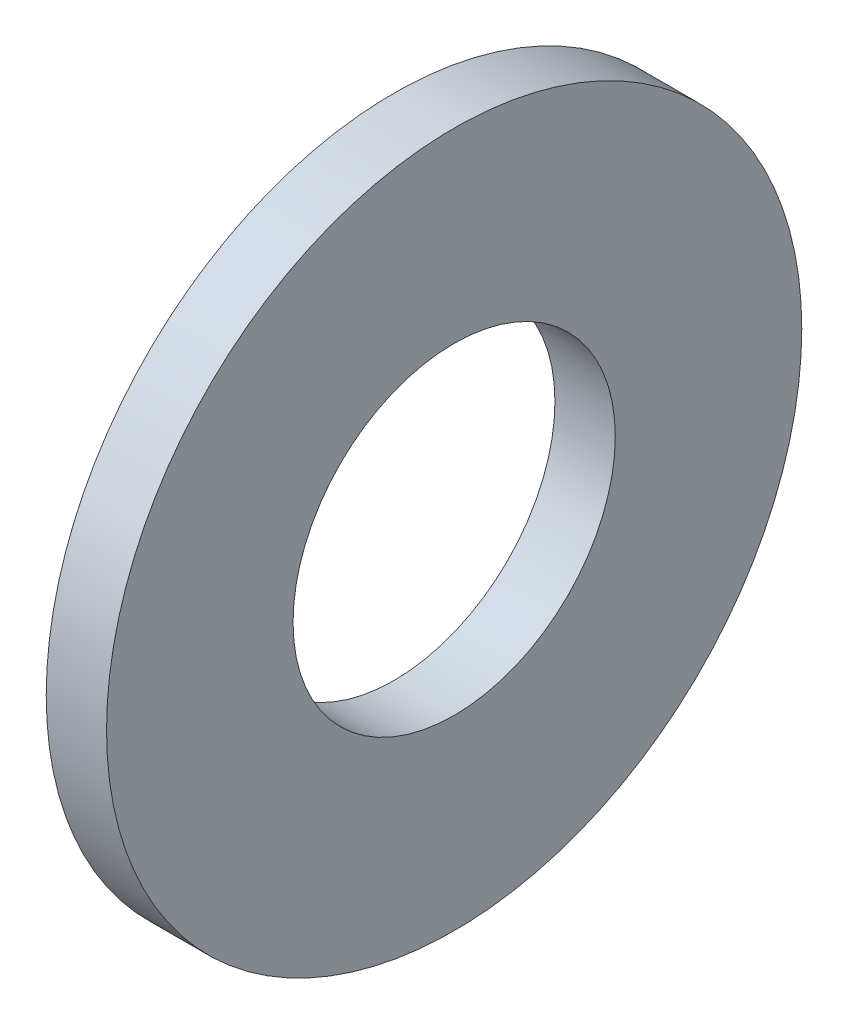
ISO-10303-21;
HEADER;
FILE_DESCRIPTION(('STEP AP214'),'2;1');
FILE_NAME('part.step','',(''),(''),'','','');
FILE_SCHEMA(('AUTOMOTIVE_DESIGN { 1 0 10303 214 1 1 1 1 }'));
ENDSEC;
DATA;
#1=APPLICATION_CONTEXT('core data for automotive mechanical design processes');
#2=APPLICATION_PROTOCOL_DEFINITION('international standard','automotive_design',2000,#1);
#3=PRODUCT_CONTEXT('',#1,'mechanical');
#4=PRODUCT('Part','Part','',(#3));
#5=PRODUCT_RELATED_PRODUCT_CATEGORY('part','',(#4));
#6=PRODUCT_DEFINITION_FORMATION('','',#4);
#7=PRODUCT_DEFINITION_CONTEXT('part definition',#1,'design');
#8=PRODUCT_DEFINITION('design','',#6,#7);
#9=PRODUCT_DEFINITION_SHAPE('','',#8);
#10=(LENGTH_UNIT() NAMED_UNIT(*) SI_UNIT(.MILLI.,.METRE.));
#11=(NAMED_UNIT(*) PLANE_ANGLE_UNIT() SI_UNIT($,.RADIAN.));
#12=(NAMED_UNIT(*) SI_UNIT($,.STERADIAN.) SOLID_ANGLE_UNIT());
#13=UNCERTAINTY_MEASURE_WITH_UNIT(LENGTH_MEASURE(1.E-05),#10,'distance_accuracy_value','');
#14=(GEOMETRIC_REPRESENTATION_CONTEXT(3) GLOBAL_UNCERTAINTY_ASSIGNED_CONTEXT((#13)) GLOBAL_UNIT_ASSIGNED_CONTEXT((#10,
#11,#12)) REPRESENTATION_CONTEXT('',''));
#15=CARTESIAN_POINT('',(0.,0.,0.));
#16=DIRECTION('',(0.,0.,1.));
#17=DIRECTION('',(1.,0.,0.));
#18=AXIS2_PLACEMENT_3D('',#15,#16,#17);
#19=CARTESIAN_POINT('',(0.9652,0.,0.));
#20=DIRECTION('',(1.,0.,0.));
#21=DIRECTION('',(0.,0.,-1.));
#22=AXIS2_PLACEMENT_3D('',#19,#20,#21);
#23=PLANE('',#22);
#24=CARTESIAN_POINT('',(0.9652,0.,0.));
#25=DIRECTION('',(1.,0.,0.));
#26=DIRECTION('',(0.,0.,-1.));
#27=AXIS2_PLACEMENT_3D('',#24,#25,#26);
#28=CIRCLE('',#27,5.5626);
#29=CARTESIAN_POINT('',(0.9652,0.,5.5626));
#30=VERTEX_POINT('',#29);
#31=EDGE_CURVE('E10',#30,#30,#28,.T.);
#32=ORIENTED_EDGE('',*,*,#31,.T.);
#33=EDGE_LOOP('',(#32));
#34=FACE_BOUND('',#33,.T.);
#35=CARTESIAN_POINT('',(0.9652,0.,0.));
#36=DIRECTION('',(1.,0.,0.));
#37=DIRECTION('',(0.,0.,-1.));
#38=AXIS2_PLACEMENT_3D('',#35,#36,#37);
#39=CIRCLE('',#38,2.5781);
#40=CARTESIAN_POINT('',(0.9652,0.,2.5781));
#41=VERTEX_POINT('',#40);
#42=EDGE_CURVE('E41',#41,#41,#39,.T.);
#43=ORIENTED_EDGE('',*,*,#42,.F.);
#44=EDGE_LOOP('',(#43));
#45=FACE_BOUND('',#44,.T.);
#46=ADVANCED_FACE('F30',(#34,#45),#23,.T.);
#47=CARTESIAN_POINT('',(0.,0.,0.));
#48=DIRECTION('',(1.,0.,0.));
#49=DIRECTION('',(0.,0.,-1.));
#50=AXIS2_PLACEMENT_3D('',#47,#48,#49);
#51=PLANE('',#50);
#52=CARTESIAN_POINT('',(0.,0.,0.));
#53=DIRECTION('',(1.,0.,0.));
#54=DIRECTION('',(0.,0.,-1.));
#55=AXIS2_PLACEMENT_3D('',#52,#53,#54);
#56=CIRCLE('',#55,5.5626);
#57=CARTESIAN_POINT('',(0.,0.,5.5626));
#58=VERTEX_POINT('',#57);
#59=EDGE_CURVE('E34',#58,#58,#56,.T.);
#60=ORIENTED_EDGE('',*,*,#59,.F.);
#61=EDGE_LOOP('',(#60));
#62=FACE_BOUND('',#61,.T.);
#63=CARTESIAN_POINT('',(0.,0.,0.));
#64=DIRECTION('',(1.,0.,0.));
#65=DIRECTION('',(0.,0.,-1.));
#66=AXIS2_PLACEMENT_3D('',#63,#64,#65);
#67=CIRCLE('',#66,2.5781);
#68=CARTESIAN_POINT('',(0.,0.,2.5781));
#69=VERTEX_POINT('',#68);
#70=EDGE_CURVE('E43',#69,#69,#67,.T.);
#71=ORIENTED_EDGE('',*,*,#70,.T.);
#72=EDGE_LOOP('',(#71));
#73=FACE_BOUND('',#72,.T.);
#74=ADVANCED_FACE('F53',(#62,#73),#51,.F.);
#75=CARTESIAN_POINT('',(0.9652,0.,0.));
#76=DIRECTION('',(-1.,0.,0.));
#77=DIRECTION('',(0.,0.,1.));
#78=AXIS2_PLACEMENT_3D('',#75,#76,#77);
#79=CYLINDRICAL_SURFACE('',#78,5.5626);
#80=CARTESIAN_POINT('',(0.9652,0.,5.5626));
#81=CARTESIAN_POINT('',(0.955145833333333,0.,5.5626));
#82=CARTESIAN_POINT('',(0.945091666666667,0.,5.5626));
#83=CARTESIAN_POINT('',(0.924983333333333,0.,5.5626));
#84=CARTESIAN_POINT('',(0.914929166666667,0.,5.5626));
#85=CARTESIAN_POINT('',(0.894820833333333,0.,5.5626));
#86=CARTESIAN_POINT('',(0.884766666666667,0.,5.5626));
#87=CARTESIAN_POINT('',(0.864658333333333,0.,5.5626));
#88=CARTESIAN_POINT('',(0.854604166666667,0.,5.5626));
#89=CARTESIAN_POINT('',(0.834495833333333,0.,5.5626));
#90=CARTESIAN_POINT('',(0.824441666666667,0.,5.5626));
#91=CARTESIAN_POINT('',(0.804333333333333,0.,5.5626));
#92=CARTESIAN_POINT('',(0.794279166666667,0.,5.5626));
#93=CARTESIAN_POINT('',(0.774170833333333,0.,5.5626));
#94=CARTESIAN_POINT('',(0.764116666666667,0.,5.5626));
#95=CARTESIAN_POINT('',(0.744008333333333,0.,5.5626));
#96=CARTESIAN_POINT('',(0.733954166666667,0.,5.5626));
#97=CARTESIAN_POINT('',(0.713845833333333,0.,5.5626));
#98=CARTESIAN_POINT('',(0.703791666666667,0.,5.5626));
#99=CARTESIAN_POINT('',(0.683683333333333,0.,5.5626));
#100=CARTESIAN_POINT('',(0.673629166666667,0.,5.5626));
#101=CARTESIAN_POINT('',(0.653520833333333,0.,5.5626));
#102=CARTESIAN_POINT('',(0.643466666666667,0.,5.5626));
#103=CARTESIAN_POINT('',(0.623358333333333,0.,5.5626));
#104=CARTESIAN_POINT('',(0.613304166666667,0.,5.5626));
#105=CARTESIAN_POINT('',(0.593195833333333,0.,5.5626));
#106=CARTESIAN_POINT('',(0.583141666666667,0.,5.5626));
#107=CARTESIAN_POINT('',(0.563033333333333,0.,5.5626));
#108=CARTESIAN_POINT('',(0.552979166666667,0.,5.5626));
#109=CARTESIAN_POINT('',(0.532870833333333,0.,5.5626));
#110=CARTESIAN_POINT('',(0.522816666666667,0.,5.5626));
#111=CARTESIAN_POINT('',(0.502708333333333,0.,5.5626));
#112=CARTESIAN_POINT('',(0.492654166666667,0.,5.5626));
#113=CARTESIAN_POINT('',(0.472545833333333,0.,5.5626));
#114=CARTESIAN_POINT('',(0.462491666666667,0.,5.5626));
#115=CARTESIAN_POINT('',(0.442383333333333,0.,5.5626));
#116=CARTESIAN_POINT('',(0.432329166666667,0.,5.5626));
#117=CARTESIAN_POINT('',(0.412220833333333,0.,5.5626));
#118=CARTESIAN_POINT('',(0.402166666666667,0.,5.5626));
#119=CARTESIAN_POINT('',(0.382058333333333,0.,5.5626));
#120=CARTESIAN_POINT('',(0.372004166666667,0.,5.5626));
#121=CARTESIAN_POINT('',(0.351895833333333,0.,5.5626));
#122=CARTESIAN_POINT('',(0.341841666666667,0.,5.5626));
#123=CARTESIAN_POINT('',(0.321733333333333,0.,5.5626));
#124=CARTESIAN_POINT('',(0.311679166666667,0.,5.5626));
#125=CARTESIAN_POINT('',(0.291570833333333,0.,5.5626));
#126=CARTESIAN_POINT('',(0.281516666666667,0.,5.5626));
#127=CARTESIAN_POINT('',(0.261408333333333,0.,5.5626));
#128=CARTESIAN_POINT('',(0.251354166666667,0.,5.5626));
#129=CARTESIAN_POINT('',(0.231245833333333,0.,5.5626));
#130=CARTESIAN_POINT('',(0.221191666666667,0.,5.5626));
#131=CARTESIAN_POINT('',(0.201083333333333,0.,5.5626));
#132=CARTESIAN_POINT('',(0.191029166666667,0.,5.5626));
#133=CARTESIAN_POINT('',(0.170920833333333,0.,5.5626));
#134=CARTESIAN_POINT('',(0.160866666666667,0.,5.5626));
#135=CARTESIAN_POINT('',(0.140758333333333,0.,5.5626));
#136=CARTESIAN_POINT('',(0.130704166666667,0.,5.5626));
#137=CARTESIAN_POINT('',(0.110595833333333,0.,5.5626));
#138=CARTESIAN_POINT('',(0.100541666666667,0.,5.5626));
#139=CARTESIAN_POINT('',(0.0804333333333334,0.,5.5626));
#140=CARTESIAN_POINT('',(0.0703791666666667,0.,5.5626));
#141=CARTESIAN_POINT('',(0.0502708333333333,0.,5.5626));
#142=CARTESIAN_POINT('',(0.0402166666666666,0.,5.5626));
#143=CARTESIAN_POINT('',(0.0201083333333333,0.,5.5626));
#144=CARTESIAN_POINT('',(0.0100541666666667,0.,5.5626));
#145=CARTESIAN_POINT('',(0.,0.,5.5626));
#146=B_SPLINE_CURVE_WITH_KNOTS('',3,(#80,#81,#82,#83,#84,#85,#86,#87,#88,#89,#90,#91,#92,#93,
#94,#95,#96,#97,#98,#99,#100,#101,#102,#103,#104,#105,#106,#107,#108,#109,#110,#111,#112,#113,
#114,#115,#116,#117,#118,#119,#120,#121,#122,#123,#124,#125,#126,#127,#128,#129,#130,#131,#132,
#133,#134,#135,#136,#137,#138,#139,#140,#141,#142,#143,#144,#145),.UNSPECIFIED.,.F.,.F.,(4,2,2,
2,2,2,2,2,2,2,2,2,2,2,2,2,2,2,2,2,2,2,2,2,2,2,2,2,2,2,2,2,4),(0.,0.0301625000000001,
0.0603250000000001,0.0904875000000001,0.12065,0.1508125,0.180975,0.2111375,0.2413,0.2714625,
0.301625,0.3317875,0.36195,0.3921125,0.422275,0.4524375,0.4826,0.5127625,0.542925,0.5730875,
0.60325,0.6334125,0.663575,0.6937375,0.7239,0.7540625,0.784225,0.8143875,0.84455,0.8747125,
0.904875,0.9350375,0.9652),.UNSPECIFIED.);
#147=EDGE_CURVE('BSEAM32',#30,#58,#146,.T.);
#148=ORIENTED_EDGE('',*,*,#31,.F.);
#149=ORIENTED_EDGE('',*,*,#59,.T.);
#150=ORIENTED_EDGE('',*,*,#147,.T.);
#151=ORIENTED_EDGE('',*,*,#147,.F.);
#152=EDGE_LOOP('',(#148,#150,#149,#151));
#153=FACE_BOUND('',#152,.T.);
#154=ADVANCED_FACE('F32',(#153),#79,.T.);
#155=CARTESIAN_POINT('',(0.9652,0.,0.));
#156=DIRECTION('',(-1.,0.,0.));
#157=DIRECTION('',(0.,0.,1.));
#158=AXIS2_PLACEMENT_3D('',#155,#156,#157);
#159=CYLINDRICAL_SURFACE('',#158,2.5781);
#160=CARTESIAN_POINT('',(0.9652,0.,2.5781));
#161=CARTESIAN_POINT('',(0.955145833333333,0.,2.5781));
#162=CARTESIAN_POINT('',(0.945091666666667,0.,2.5781));
#163=CARTESIAN_POINT('',(0.924983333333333,0.,2.5781));
#164=CARTESIAN_POINT('',(0.914929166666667,0.,2.5781));
#165=CARTESIAN_POINT('',(0.894820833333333,0.,2.5781));
#166=CARTESIAN_POINT('',(0.884766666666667,0.,2.5781));
#167=CARTESIAN_POINT('',(0.864658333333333,0.,2.5781));
#168=CARTESIAN_POINT('',(0.854604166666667,0.,2.5781));
#169=CARTESIAN_POINT('',(0.834495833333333,0.,2.5781));
#170=CARTESIAN_POINT('',(0.824441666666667,0.,2.5781));
#171=CARTESIAN_POINT('',(0.804333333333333,0.,2.5781));
#172=CARTESIAN_POINT('',(0.794279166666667,0.,2.5781));
#173=CARTESIAN_POINT('',(0.774170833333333,0.,2.5781));
#174=CARTESIAN_POINT('',(0.764116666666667,0.,2.5781));
#175=CARTESIAN_POINT('',(0.744008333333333,0.,2.5781));
#176=CARTESIAN_POINT('',(0.733954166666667,0.,2.5781));
#177=CARTESIAN_POINT('',(0.713845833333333,0.,2.5781));
#178=CARTESIAN_POINT('',(0.703791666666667,0.,2.5781));
#179=CARTESIAN_POINT('',(0.683683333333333,0.,2.5781));
#180=CARTESIAN_POINT('',(0.673629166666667,0.,2.5781));
#181=CARTESIAN_POINT('',(0.653520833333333,0.,2.5781));
#182=CARTESIAN_POINT('',(0.643466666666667,0.,2.5781));
#183=CARTESIAN_POINT('',(0.623358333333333,0.,2.5781));
#184=CARTESIAN_POINT('',(0.613304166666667,0.,2.5781));
#185=CARTESIAN_POINT('',(0.593195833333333,0.,2.5781));
#186=CARTESIAN_POINT('',(0.583141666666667,0.,2.5781));
#187=CARTESIAN_POINT('',(0.563033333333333,0.,2.5781));
#188=CARTESIAN_POINT('',(0.552979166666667,0.,2.5781));
#189=CARTESIAN_POINT('',(0.532870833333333,0.,2.5781));
#190=CARTESIAN_POINT('',(0.522816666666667,0.,2.5781));
#191=CARTESIAN_POINT('',(0.502708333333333,0.,2.5781));
#192=CARTESIAN_POINT('',(0.492654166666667,0.,2.5781));
#193=CARTESIAN_POINT('',(0.472545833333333,0.,2.5781));
#194=CARTESIAN_POINT('',(0.462491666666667,0.,2.5781));
#195=CARTESIAN_POINT('',(0.442383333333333,0.,2.5781));
#196=CARTESIAN_POINT('',(0.432329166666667,0.,2.5781));
#197=CARTESIAN_POINT('',(0.412220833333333,0.,2.5781));
#198=CARTESIAN_POINT('',(0.402166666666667,0.,2.5781));
#199=CARTESIAN_POINT('',(0.382058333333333,0.,2.5781));
#200=CARTESIAN_POINT('',(0.372004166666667,0.,2.5781));
#201=CARTESIAN_POINT('',(0.351895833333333,0.,2.5781));
#202=CARTESIAN_POINT('',(0.341841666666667,0.,2.5781));
#203=CARTESIAN_POINT('',(0.321733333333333,0.,2.5781));
#204=CARTESIAN_POINT('',(0.311679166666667,0.,2.5781));
#205=CARTESIAN_POINT('',(0.291570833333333,0.,2.5781));
#206=CARTESIAN_POINT('',(0.281516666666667,0.,2.5781));
#207=CARTESIAN_POINT('',(0.261408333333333,0.,2.5781));
#208=CARTESIAN_POINT('',(0.251354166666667,0.,2.5781));
#209=CARTESIAN_POINT('',(0.231245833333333,0.,2.5781));
#210=CARTESIAN_POINT('',(0.221191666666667,0.,2.5781));
#211=CARTESIAN_POINT('',(0.201083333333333,0.,2.5781));
#212=CARTESIAN_POINT('',(0.191029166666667,0.,2.5781));
#213=CARTESIAN_POINT('',(0.170920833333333,0.,2.5781));
#214=CARTESIAN_POINT('',(0.160866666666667,0.,2.5781));
#215=CARTESIAN_POINT('',(0.140758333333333,0.,2.5781));
#216=CARTESIAN_POINT('',(0.130704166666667,0.,2.5781));
#217=CARTESIAN_POINT('',(0.110595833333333,0.,2.5781));
#218=CARTESIAN_POINT('',(0.100541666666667,0.,2.5781));
#219=CARTESIAN_POINT('',(0.0804333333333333,0.,2.5781));
#220=CARTESIAN_POINT('',(0.0703791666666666,0.,2.5781));
#221=CARTESIAN_POINT('',(0.0502708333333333,0.,2.5781));
#222=CARTESIAN_POINT('',(0.0402166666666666,0.,2.5781));
#223=CARTESIAN_POINT('',(0.0201083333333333,0.,2.5781));
#224=CARTESIAN_POINT('',(0.0100541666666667,0.,2.5781));
#225=CARTESIAN_POINT('',(0.,0.,2.5781));
#226=B_SPLINE_CURVE_WITH_KNOTS('',3,(#160,#161,#162,#163,#164,#165,#166,#167,#168,#169,#170,
#171,#172,#173,#174,#175,#176,#177,#178,#179,#180,#181,#182,#183,#184,#185,#186,#187,#188,#189,
#190,#191,#192,#193,#194,#195,#196,#197,#198,#199,#200,#201,#202,#203,#204,#205,#206,#207,#208,
#209,#210,#211,#212,#213,#214,#215,#216,#217,#218,#219,#220,#221,#222,#223,#224,#225),
.UNSPECIFIED.,.F.,.F.,(4,2,2,2,2,2,2,2,2,2,2,2,2,2,2,2,2,2,2,2,2,2,2,2,2,2,2,2,2,2,2,2,4),(0.,
0.0301625,0.060325,0.0904874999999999,0.12065,0.1508125,0.180975,0.2111375,0.2413,0.2714625,
0.301625,0.3317875,0.36195,0.3921125,0.422275,0.4524375,0.4826,0.5127625,0.542925,0.5730875,
0.60325,0.6334125,0.663575,0.6937375,0.7239,0.7540625,0.784225,0.8143875,0.84455,0.8747125,
0.904875,0.9350375,0.9652),.UNSPECIFIED.);
#227=EDGE_CURVE('BSEAM49',#41,#69,#226,.T.);
#228=ORIENTED_EDGE('',*,*,#42,.T.);
#229=ORIENTED_EDGE('',*,*,#70,.F.);
#230=ORIENTED_EDGE('',*,*,#227,.T.);
#231=ORIENTED_EDGE('',*,*,#227,.F.);
#232=EDGE_LOOP('',(#228,#230,#229,#231));
#233=FACE_BOUND('',#232,.T.);
#234=ADVANCED_FACE('F49',(#233),#159,.F.);
#235=CLOSED_SHELL('',(#46,#74,#154,#234));
#236=MANIFOLD_SOLID_BREP('B2',#235);
#237=ADVANCED_BREP_SHAPE_REPRESENTATION('',(#18,#236),#14);
#238=SHAPE_DEFINITION_REPRESENTATION(#9,#237);
ENDSEC;
END-ISO-10303-21;
